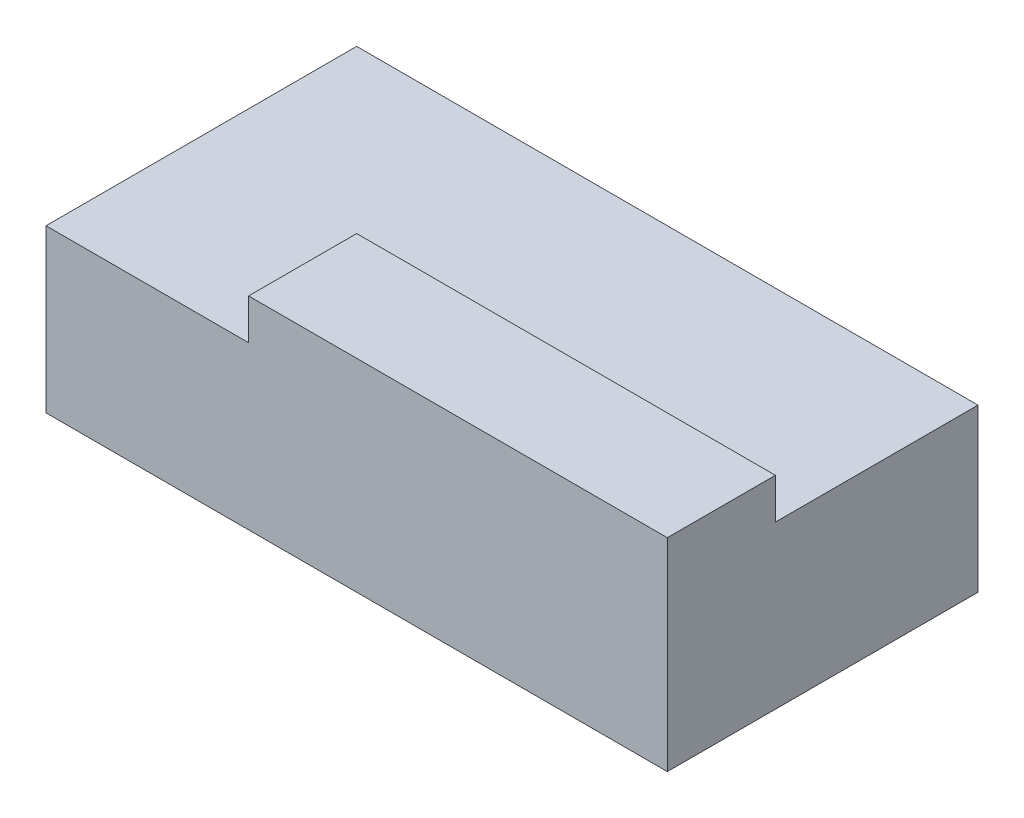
ISO-10303-21;
HEADER;
FILE_DESCRIPTION(('STEP AP214'),'2;1');
FILE_NAME('part.step','',(''),(''),'','','');
FILE_SCHEMA(('AUTOMOTIVE_DESIGN { 1 0 10303 214 1 1 1 1 }'));
ENDSEC;
DATA;
#1=APPLICATION_CONTEXT('core data for automotive mechanical design processes');
#2=APPLICATION_PROTOCOL_DEFINITION('international standard','automotive_design',2000,#1);
#3=PRODUCT_CONTEXT('',#1,'mechanical');
#4=PRODUCT('Part','Part','',(#3));
#5=PRODUCT_RELATED_PRODUCT_CATEGORY('part','',(#4));
#6=PRODUCT_DEFINITION_FORMATION('','',#4);
#7=PRODUCT_DEFINITION_CONTEXT('part definition',#1,'design');
#8=PRODUCT_DEFINITION('design','',#6,#7);
#9=PRODUCT_DEFINITION_SHAPE('','',#8);
#10=(LENGTH_UNIT() NAMED_UNIT(*) SI_UNIT(.MILLI.,.METRE.));
#11=(NAMED_UNIT(*) PLANE_ANGLE_UNIT() SI_UNIT($,.RADIAN.));
#12=(NAMED_UNIT(*) SI_UNIT($,.STERADIAN.) SOLID_ANGLE_UNIT());
#13=UNCERTAINTY_MEASURE_WITH_UNIT(LENGTH_MEASURE(1.E-05),#10,'distance_accuracy_value','');
#14=(GEOMETRIC_REPRESENTATION_CONTEXT(3) GLOBAL_UNCERTAINTY_ASSIGNED_CONTEXT((#13)) GLOBAL_UNIT_ASSIGNED_CONTEXT((#10,
#11,#12)) REPRESENTATION_CONTEXT('',''));
#15=CARTESIAN_POINT('',(0.,0.,0.));
#16=DIRECTION('',(0.,0.,1.));
#17=DIRECTION('',(1.,0.,0.));
#18=AXIS2_PLACEMENT_3D('',#15,#16,#17);
#19=CARTESIAN_POINT('',(-115.,37.5,-57.5));
#20=DIRECTION('',(0.,0.,1.));
#21=DIRECTION('',(1.,0.,0.));
#22=AXIS2_PLACEMENT_3D('',#19,#20,#21);
#23=PLANE('',#22);
#24=DIRECTION('',(-1.,0.,0.));
#25=VECTOR('',#24,1.);
#26=CARTESIAN_POINT('',(-115.,22.5,-57.5));
#27=LINE('',#26,#25);
#28=CARTESIAN_POINT('',(115.,22.5,-57.5));
#29=VERTEX_POINT('',#28);
#30=CARTESIAN_POINT('',(-115.,22.5,-57.5));
#31=VERTEX_POINT('',#30);
#32=EDGE_CURVE('E133',#29,#31,#27,.T.);
#33=ORIENTED_EDGE('',*,*,#32,.F.);
#34=DIRECTION('',(0.,-1.,0.));
#35=VECTOR('',#34,1.);
#36=CARTESIAN_POINT('',(115.,37.5,-57.5));
#37=LINE('',#36,#35);
#38=CARTESIAN_POINT('',(115.,-37.5,-57.5));
#39=VERTEX_POINT('',#38);
#40=EDGE_CURVE('E11',#29,#39,#37,.T.);
#41=ORIENTED_EDGE('',*,*,#40,.T.);
#42=DIRECTION('',(-1.,0.,0.));
#43=VECTOR('',#42,1.);
#44=CARTESIAN_POINT('',(-115.,-37.5,-57.5));
#45=LINE('',#44,#43);
#46=CARTESIAN_POINT('',(-115.,-37.5,-57.5));
#47=VERTEX_POINT('',#46);
#48=EDGE_CURVE('E102',#39,#47,#45,.T.);
#49=ORIENTED_EDGE('',*,*,#48,.T.);
#50=DIRECTION('',(0.,-1.,0.));
#51=VECTOR('',#50,1.);
#52=CARTESIAN_POINT('',(-115.,37.5,-57.5));
#53=LINE('',#52,#51);
#54=EDGE_CURVE('E48',#31,#47,#53,.T.);
#55=ORIENTED_EDGE('',*,*,#54,.F.);
#56=EDGE_LOOP('',(#33,#41,#49,#55));
#57=FACE_BOUND('',#56,.T.);
#58=ADVANCED_FACE('F39',(#57),#23,.F.);
#59=CARTESIAN_POINT('',(-115.,37.5,-57.5));
#60=DIRECTION('',(1.,0.,0.));
#61=DIRECTION('',(0.,0.,-1.));
#62=AXIS2_PLACEMENT_3D('',#59,#60,#61);
#63=PLANE('',#62);
#64=DIRECTION('',(0.,0.,1.));
#65=VECTOR('',#64,1.);
#66=CARTESIAN_POINT('',(-115.,22.5,-57.5));
#67=LINE('',#66,#65);
#68=CARTESIAN_POINT('',(-115.,22.5,57.5));
#69=VERTEX_POINT('',#68);
#70=EDGE_CURVE('E141',#31,#69,#67,.T.);
#71=ORIENTED_EDGE('',*,*,#70,.F.);
#72=ORIENTED_EDGE('',*,*,#54,.T.);
#73=DIRECTION('',(0.,0.,1.));
#74=VECTOR('',#73,1.);
#75=CARTESIAN_POINT('',(-115.,-37.5,-57.5));
#76=LINE('',#75,#74);
#77=CARTESIAN_POINT('',(-115.,-37.5,57.5));
#78=VERTEX_POINT('',#77);
#79=EDGE_CURVE('E95',#47,#78,#76,.T.);
#80=ORIENTED_EDGE('',*,*,#79,.T.);
#81=DIRECTION('',(0.,-1.,0.));
#82=VECTOR('',#81,1.);
#83=CARTESIAN_POINT('',(-115.,37.5,57.5));
#84=LINE('',#83,#82);
#85=EDGE_CURVE('E80',#69,#78,#84,.T.);
#86=ORIENTED_EDGE('',*,*,#85,.F.);
#87=EDGE_LOOP('',(#71,#72,#80,#86));
#88=FACE_BOUND('',#87,.T.);
#89=ADVANCED_FACE('F96',(#88),#63,.F.);
#90=CARTESIAN_POINT('',(115.,37.5,-57.5));
#91=DIRECTION('',(-1.,0.,0.));
#92=DIRECTION('',(0.,0.,1.));
#93=AXIS2_PLACEMENT_3D('',#90,#91,#92);
#94=PLANE('',#93);
#95=DIRECTION('',(0.,0.,-1.));
#96=VECTOR('',#95,1.);
#97=CARTESIAN_POINT('',(115.,22.5,-57.5));
#98=LINE('',#97,#96);
#99=CARTESIAN_POINT('',(115.,22.5,17.5));
#100=VERTEX_POINT('',#99);
#101=EDGE_CURVE('E156',#100,#29,#98,.T.);
#102=ORIENTED_EDGE('',*,*,#101,.F.);
#103=DIRECTION('',(0.,1.,0.));
#104=VECTOR('',#103,1.);
#105=CARTESIAN_POINT('',(115.,22.5,17.5));
#106=LINE('',#105,#104);
#107=CARTESIAN_POINT('',(115.,37.5,17.5));
#108=VERTEX_POINT('',#107);
#109=EDGE_CURVE('E142',#100,#108,#106,.T.);
#110=ORIENTED_EDGE('',*,*,#109,.T.);
#111=DIRECTION('',(0.,0.,-1.));
#112=VECTOR('',#111,1.);
#113=CARTESIAN_POINT('',(115.,37.5,-57.5));
#114=LINE('',#113,#112);
#115=CARTESIAN_POINT('',(115.,37.5,57.5));
#116=VERTEX_POINT('',#115);
#117=EDGE_CURVE('E109',#116,#108,#114,.T.);
#118=ORIENTED_EDGE('',*,*,#117,.F.);
#119=DIRECTION('',(0.,-1.,0.));
#120=VECTOR('',#119,1.);
#121=CARTESIAN_POINT('',(115.,37.5,57.5));
#122=LINE('',#121,#120);
#123=CARTESIAN_POINT('',(115.,-37.5,57.5));
#124=VERTEX_POINT('',#123);
#125=EDGE_CURVE('E92',#116,#124,#122,.T.);
#126=ORIENTED_EDGE('',*,*,#125,.T.);
#127=DIRECTION('',(0.,0.,-1.));
#128=VECTOR('',#127,1.);
#129=CARTESIAN_POINT('',(115.,-37.5,-57.5));
#130=LINE('',#129,#128);
#131=EDGE_CURVE('E107',#124,#39,#130,.T.);
#132=ORIENTED_EDGE('',*,*,#131,.T.);
#133=ORIENTED_EDGE('',*,*,#40,.F.);
#134=EDGE_LOOP('',(#102,#110,#118,#126,#132,#133));
#135=FACE_BOUND('',#134,.T.);
#136=ADVANCED_FACE('F41',(#135),#94,.F.);
#137=CARTESIAN_POINT('',(-115.,37.5,57.5));
#138=DIRECTION('',(0.,0.,-1.));
#139=DIRECTION('',(-1.,0.,0.));
#140=AXIS2_PLACEMENT_3D('',#137,#138,#139);
#141=PLANE('',#140);
#142=DIRECTION('',(1.,0.,0.));
#143=VECTOR('',#142,1.);
#144=CARTESIAN_POINT('',(-115.,37.5,57.5));
#145=LINE('',#144,#143);
#146=CARTESIAN_POINT('',(-40.,37.5,57.5));
#147=VERTEX_POINT('',#146);
#148=EDGE_CURVE('E63',#147,#116,#145,.T.);
#149=ORIENTED_EDGE('',*,*,#148,.F.);
#150=DIRECTION('',(0.,1.,0.));
#151=VECTOR('',#150,1.);
#152=CARTESIAN_POINT('',(-40.,22.5,57.5));
#153=LINE('',#152,#151);
#154=CARTESIAN_POINT('',(-40.,22.5,57.5));
#155=VERTEX_POINT('',#154);
#156=EDGE_CURVE('E55',#155,#147,#153,.T.);
#157=ORIENTED_EDGE('',*,*,#156,.F.);
#158=DIRECTION('',(1.,0.,0.));
#159=VECTOR('',#158,1.);
#160=CARTESIAN_POINT('',(-115.,22.5,57.5));
#161=LINE('',#160,#159);
#162=EDGE_CURVE('E88',#69,#155,#161,.T.);
#163=ORIENTED_EDGE('',*,*,#162,.F.);
#164=ORIENTED_EDGE('',*,*,#85,.T.);
#165=DIRECTION('',(1.,0.,0.));
#166=VECTOR('',#165,1.);
#167=CARTESIAN_POINT('',(-115.,-37.5,57.5));
#168=LINE('',#167,#166);
#169=EDGE_CURVE('E84',#78,#124,#168,.T.);
#170=ORIENTED_EDGE('',*,*,#169,.T.);
#171=ORIENTED_EDGE('',*,*,#125,.F.);
#172=EDGE_LOOP('',(#149,#157,#163,#164,#170,#171));
#173=FACE_BOUND('',#172,.T.);
#174=ADVANCED_FACE('F82',(#173),#141,.F.);
#175=CARTESIAN_POINT('',(0.,37.5,0.));
#176=DIRECTION('',(0.,1.,0.));
#177=DIRECTION('',(0.,0.,1.));
#178=AXIS2_PLACEMENT_3D('',#175,#176,#177);
#179=PLANE('',#178);
#180=DIRECTION('',(1.,0.,0.));
#181=VECTOR('',#180,1.);
#182=CARTESIAN_POINT('',(-40.,37.5,17.5));
#183=LINE('',#182,#181);
#184=CARTESIAN_POINT('',(-40.,37.5,17.5));
#185=VERTEX_POINT('',#184);
#186=EDGE_CURVE('E159',#185,#108,#183,.T.);
#187=ORIENTED_EDGE('',*,*,#186,.F.);
#188=DIRECTION('',(0.,0.,-1.));
#189=VECTOR('',#188,1.);
#190=CARTESIAN_POINT('',(-40.,37.5,-57.5));
#191=LINE('',#190,#189);
#192=EDGE_CURVE('E139',#147,#185,#191,.T.);
#193=ORIENTED_EDGE('',*,*,#192,.F.);
#194=ORIENTED_EDGE('',*,*,#148,.T.);
#195=ORIENTED_EDGE('',*,*,#117,.T.);
#196=EDGE_LOOP('',(#187,#193,#194,#195));
#197=FACE_BOUND('',#196,.T.);
#198=ADVANCED_FACE('F182',(#197),#179,.T.);
#199=CARTESIAN_POINT('',(0.,-37.5,0.));
#200=DIRECTION('',(0.,1.,0.));
#201=DIRECTION('',(0.,0.,1.));
#202=AXIS2_PLACEMENT_3D('',#199,#200,#201);
#203=PLANE('',#202);
#204=ORIENTED_EDGE('',*,*,#131,.F.);
#205=ORIENTED_EDGE('',*,*,#169,.F.);
#206=ORIENTED_EDGE('',*,*,#79,.F.);
#207=ORIENTED_EDGE('',*,*,#48,.F.);
#208=EDGE_LOOP('',(#204,#205,#206,#207));
#209=FACE_BOUND('',#208,.T.);
#210=ADVANCED_FACE('F105',(#209),#203,.F.);
#211=CARTESIAN_POINT('',(-40.,22.5,-57.5));
#212=DIRECTION('',(1.,0.,0.));
#213=DIRECTION('',(0.,0.,-1.));
#214=AXIS2_PLACEMENT_3D('',#211,#212,#213);
#215=PLANE('',#214);
#216=ORIENTED_EDGE('',*,*,#192,.T.);
#217=DIRECTION('',(0.,1.,0.));
#218=VECTOR('',#217,1.);
#219=CARTESIAN_POINT('',(-40.,22.5,17.5));
#220=LINE('',#219,#218);
#221=CARTESIAN_POINT('',(-40.,22.5,17.5));
#222=VERTEX_POINT('',#221);
#223=EDGE_CURVE('E152',#222,#185,#220,.T.);
#224=ORIENTED_EDGE('',*,*,#223,.F.);
#225=DIRECTION('',(0.,0.,-1.));
#226=VECTOR('',#225,1.);
#227=CARTESIAN_POINT('',(-40.,22.5,-57.5));
#228=LINE('',#227,#226);
#229=EDGE_CURVE('E136',#155,#222,#228,.T.);
#230=ORIENTED_EDGE('',*,*,#229,.F.);
#231=ORIENTED_EDGE('',*,*,#156,.T.);
#232=EDGE_LOOP('',(#216,#224,#230,#231));
#233=FACE_BOUND('',#232,.T.);
#234=ADVANCED_FACE('F184',(#233),#215,.F.);
#235=CARTESIAN_POINT('',(0.,22.5,0.));
#236=DIRECTION('',(0.,1.,0.));
#237=DIRECTION('',(0.,0.,1.));
#238=AXIS2_PLACEMENT_3D('',#235,#236,#237);
#239=PLANE('',#238);
#240=ORIENTED_EDGE('',*,*,#70,.T.);
#241=ORIENTED_EDGE('',*,*,#162,.T.);
#242=ORIENTED_EDGE('',*,*,#229,.T.);
#243=DIRECTION('',(1.,0.,0.));
#244=VECTOR('',#243,1.);
#245=CARTESIAN_POINT('',(-40.,22.5,17.5));
#246=LINE('',#245,#244);
#247=EDGE_CURVE('E163',#222,#100,#246,.T.);
#248=ORIENTED_EDGE('',*,*,#247,.T.);
#249=ORIENTED_EDGE('',*,*,#101,.T.);
#250=ORIENTED_EDGE('',*,*,#32,.T.);
#251=EDGE_LOOP('',(#240,#241,#242,#248,#249,#250));
#252=FACE_BOUND('',#251,.T.);
#253=ADVANCED_FACE('F172',(#252),#239,.T.);
#254=CARTESIAN_POINT('',(-40.,22.5,17.5));
#255=DIRECTION('',(0.,0.,1.));
#256=DIRECTION('',(1.,0.,0.));
#257=AXIS2_PLACEMENT_3D('',#254,#255,#256);
#258=PLANE('',#257);
#259=ORIENTED_EDGE('',*,*,#186,.T.);
#260=ORIENTED_EDGE('',*,*,#109,.F.);
#261=ORIENTED_EDGE('',*,*,#247,.F.);
#262=ORIENTED_EDGE('',*,*,#223,.T.);
#263=EDGE_LOOP('',(#259,#260,#261,#262));
#264=FACE_BOUND('',#263,.T.);
#265=ADVANCED_FACE('F186',(#264),#258,.F.);
#266=CLOSED_SHELL('',(#58,#89,#136,#174,#198,#210,#234,#253,#265));
#267=MANIFOLD_SOLID_BREP('B2',#266);
#268=ADVANCED_BREP_SHAPE_REPRESENTATION('',(#18,#267),#14);
#269=SHAPE_DEFINITION_REPRESENTATION(#9,#268);
ENDSEC;
END-ISO-10303-21;
